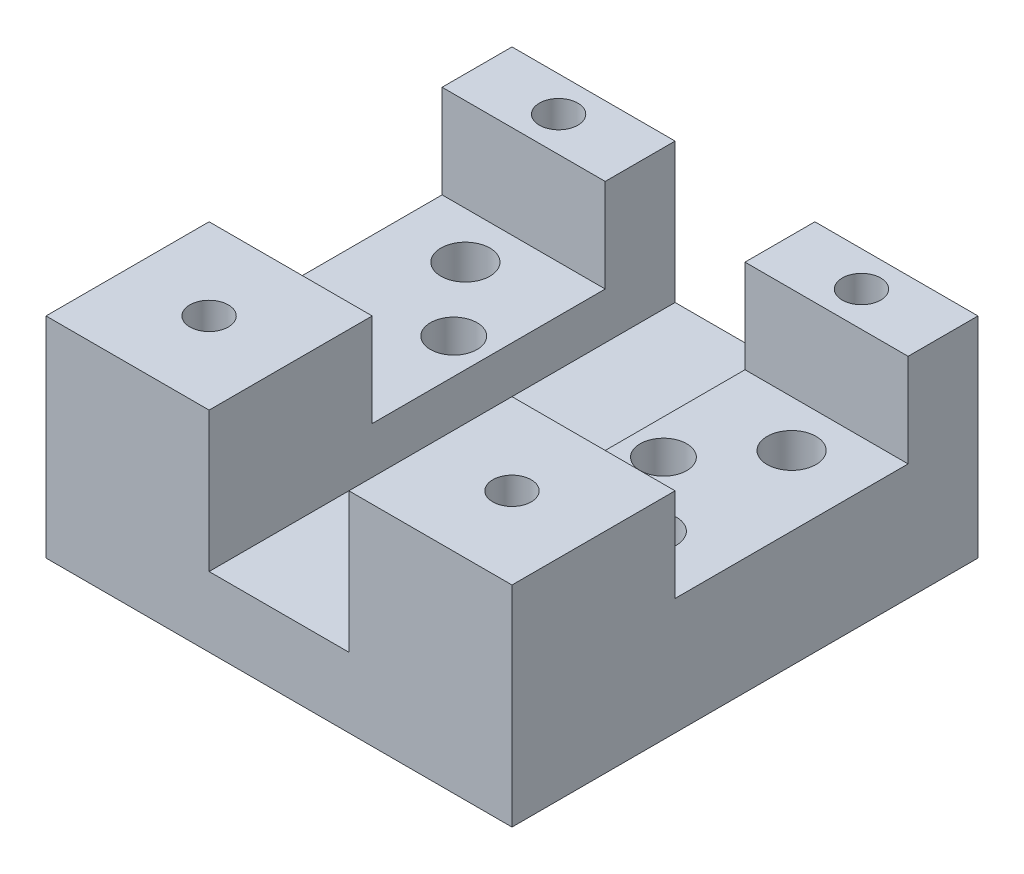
ISO-10303-21;
HEADER;
FILE_DESCRIPTION(('STEP AP214'),'2;1');
FILE_NAME('part.step','',(''),(''),'','','');
FILE_SCHEMA(('AUTOMOTIVE_DESIGN { 1 0 10303 214 1 1 1 1 }'));
ENDSEC;
DATA;
#1=APPLICATION_CONTEXT('core data for automotive mechanical design processes');
#2=APPLICATION_PROTOCOL_DEFINITION('international standard','automotive_design',2000,#1);
#3=PRODUCT_CONTEXT('',#1,'mechanical');
#4=PRODUCT('Part','Part','',(#3));
#5=PRODUCT_RELATED_PRODUCT_CATEGORY('part','',(#4));
#6=PRODUCT_DEFINITION_FORMATION('','',#4);
#7=PRODUCT_DEFINITION_CONTEXT('part definition',#1,'design');
#8=PRODUCT_DEFINITION('design','',#6,#7);
#9=PRODUCT_DEFINITION_SHAPE('','',#8);
#10=(LENGTH_UNIT() NAMED_UNIT(*) SI_UNIT(.MILLI.,.METRE.));
#11=(NAMED_UNIT(*) PLANE_ANGLE_UNIT() SI_UNIT($,.RADIAN.));
#12=(NAMED_UNIT(*) SI_UNIT($,.STERADIAN.) SOLID_ANGLE_UNIT());
#13=UNCERTAINTY_MEASURE_WITH_UNIT(LENGTH_MEASURE(1.E-05),#10,'distance_accuracy_value','');
#14=(GEOMETRIC_REPRESENTATION_CONTEXT(3) GLOBAL_UNCERTAINTY_ASSIGNED_CONTEXT((#13)) GLOBAL_UNIT_ASSIGNED_CONTEXT((#10,
#11,#12)) REPRESENTATION_CONTEXT('',''));
#15=CARTESIAN_POINT('',(0.,0.,0.));
#16=DIRECTION('',(0.,0.,1.));
#17=DIRECTION('',(1.,0.,0.));
#18=AXIS2_PLACEMENT_3D('',#15,#16,#17);
#19=CARTESIAN_POINT('',(0.,18.,0.));
#20=DIRECTION('',(0.,1.,0.));
#21=DIRECTION('',(0.,0.,1.));
#22=AXIS2_PLACEMENT_3D('',#19,#20,#21);
#23=PLANE('',#22);
#24=CARTESIAN_POINT('',(13.,18.,-17.));
#25=DIRECTION('',(0.,1.,0.));
#26=DIRECTION('',(0.,0.,1.));
#27=AXIS2_PLACEMENT_3D('',#24,#25,#26);
#28=CIRCLE('',#27,1.65);
#29=CARTESIAN_POINT('',(13.,18.,-15.35));
#30=VERTEX_POINT('',#29);
#31=EDGE_CURVE('E168',#30,#30,#28,.T.);
#32=ORIENTED_EDGE('',*,*,#31,.F.);
#33=EDGE_LOOP('',(#32));
#34=FACE_BOUND('',#33,.T.);
#35=DIRECTION('',(-1.,0.,0.));
#36=VECTOR('',#35,1.);
#37=CARTESIAN_POINT('',(31.,18.,-14.));
#38=LINE('',#37,#36);
#39=CARTESIAN_POINT('',(20.,18.,-14.));
#40=VERTEX_POINT('',#39);
#41=CARTESIAN_POINT('',(6.,18.,-14.));
#42=VERTEX_POINT('',#41);
#43=EDGE_CURVE('E215',#40,#42,#38,.T.);
#44=ORIENTED_EDGE('',*,*,#43,.F.);
#45=DIRECTION('',(0.,0.,-1.));
#46=VECTOR('',#45,1.);
#47=CARTESIAN_POINT('',(20.,18.,-20.));
#48=LINE('',#47,#46);
#49=CARTESIAN_POINT('',(20.,18.,-20.));
#50=VERTEX_POINT('',#49);
#51=EDGE_CURVE('E267',#40,#50,#48,.T.);
#52=ORIENTED_EDGE('',*,*,#51,.T.);
#53=DIRECTION('',(-1.,0.,0.));
#54=VECTOR('',#53,1.);
#55=CARTESIAN_POINT('',(-20.,18.,-20.));
#56=LINE('',#55,#54);
#57=CARTESIAN_POINT('',(6.,18.,-20.));
#58=VERTEX_POINT('',#57);
#59=EDGE_CURVE('E268',#50,#58,#56,.T.);
#60=ORIENTED_EDGE('',*,*,#59,.T.);
#61=DIRECTION('',(0.,0.,-1.));
#62=VECTOR('',#61,1.);
#63=CARTESIAN_POINT('',(6.,18.,0.));
#64=LINE('',#63,#62);
#65=EDGE_CURVE('E303',#42,#58,#64,.T.);
#66=ORIENTED_EDGE('',*,*,#65,.F.);
#67=EDGE_LOOP('',(#44,#52,#60,#66));
#68=FACE_BOUND('',#67,.T.);
#69=ADVANCED_FACE('F16',(#34,#68),#23,.T.);
#70=CARTESIAN_POINT('',(-13.,18.,-17.));
#71=DIRECTION('',(0.,1.,0.));
#72=DIRECTION('',(0.,0.,1.));
#73=AXIS2_PLACEMENT_3D('',#70,#71,#72);
#74=CIRCLE('',#73,1.65);
#75=CARTESIAN_POINT('',(-13.,18.,-15.35));
#76=VERTEX_POINT('',#75);
#77=EDGE_CURVE('E162',#76,#76,#74,.T.);
#78=ORIENTED_EDGE('',*,*,#77,.F.);
#79=EDGE_LOOP('',(#78));
#80=FACE_BOUND('',#79,.T.);
#81=CARTESIAN_POINT('',(-6.,18.,-14.));
#82=VERTEX_POINT('',#81);
#83=CARTESIAN_POINT('',(-20.,18.,-14.));
#84=VERTEX_POINT('',#83);
#85=EDGE_CURVE('E213',#82,#84,#38,.T.);
#86=ORIENTED_EDGE('',*,*,#85,.F.);
#87=DIRECTION('',(0.,0.,1.));
#88=VECTOR('',#87,1.);
#89=CARTESIAN_POINT('',(-6.,18.,0.));
#90=LINE('',#89,#88);
#91=CARTESIAN_POINT('',(-6.,18.,-20.));
#92=VERTEX_POINT('',#91);
#93=EDGE_CURVE('E300',#92,#82,#90,.T.);
#94=ORIENTED_EDGE('',*,*,#93,.F.);
#95=CARTESIAN_POINT('',(-20.,18.,-20.));
#96=VERTEX_POINT('',#95);
#97=EDGE_CURVE('E266',#92,#96,#56,.T.);
#98=ORIENTED_EDGE('',*,*,#97,.T.);
#99=DIRECTION('',(0.,0.,1.));
#100=VECTOR('',#99,1.);
#101=CARTESIAN_POINT('',(-20.,18.,-20.));
#102=LINE('',#101,#100);
#103=EDGE_CURVE('E272',#96,#84,#102,.T.);
#104=ORIENTED_EDGE('',*,*,#103,.T.);
#105=EDGE_LOOP('',(#86,#94,#98,#104));
#106=FACE_BOUND('',#105,.T.);
#107=ADVANCED_FACE('F336',(#80,#106),#23,.T.);
#108=CARTESIAN_POINT('',(13.,18.,13.));
#109=DIRECTION('',(0.,1.,0.));
#110=DIRECTION('',(0.,0.,1.));
#111=AXIS2_PLACEMENT_3D('',#108,#109,#110);
#112=CIRCLE('',#111,1.65);
#113=CARTESIAN_POINT('',(13.,18.,14.65));
#114=VERTEX_POINT('',#113);
#115=EDGE_CURVE('E151',#114,#114,#112,.T.);
#116=ORIENTED_EDGE('',*,*,#115,.F.);
#117=EDGE_LOOP('',(#116));
#118=FACE_BOUND('',#117,.T.);
#119=DIRECTION('',(-1.,0.,0.));
#120=VECTOR('',#119,1.);
#121=CARTESIAN_POINT('',(31.,18.,6.));
#122=LINE('',#121,#120);
#123=CARTESIAN_POINT('',(20.,18.,6.));
#124=VERTEX_POINT('',#123);
#125=CARTESIAN_POINT('',(6.,18.,6.));
#126=VERTEX_POINT('',#125);
#127=EDGE_CURVE('E216',#124,#126,#122,.T.);
#128=ORIENTED_EDGE('',*,*,#127,.T.);
#129=CARTESIAN_POINT('',(6.,18.,20.));
#130=VERTEX_POINT('',#129);
#131=EDGE_CURVE('E304',#130,#126,#64,.T.);
#132=ORIENTED_EDGE('',*,*,#131,.F.);
#133=DIRECTION('',(1.,0.,0.));
#134=VECTOR('',#133,1.);
#135=CARTESIAN_POINT('',(-20.,18.,20.));
#136=LINE('',#135,#134);
#137=CARTESIAN_POINT('',(20.,18.,20.));
#138=VERTEX_POINT('',#137);
#139=EDGE_CURVE('E275',#130,#138,#136,.T.);
#140=ORIENTED_EDGE('',*,*,#139,.T.);
#141=EDGE_CURVE('E263',#138,#124,#48,.T.);
#142=ORIENTED_EDGE('',*,*,#141,.T.);
#143=EDGE_LOOP('',(#128,#132,#140,#142));
#144=FACE_BOUND('',#143,.T.);
#145=ADVANCED_FACE('F344',(#118,#144),#23,.T.);
#146=CARTESIAN_POINT('',(20.,18.,-20.));
#147=DIRECTION('',(-1.,0.,0.));
#148=DIRECTION('',(0.,0.,1.));
#149=AXIS2_PLACEMENT_3D('',#146,#147,#148);
#150=PLANE('',#149);
#151=ORIENTED_EDGE('',*,*,#51,.F.);
#152=DIRECTION('',(0.,-1.,0.));
#153=VECTOR('',#152,1.);
#154=CARTESIAN_POINT('',(20.,18.,-14.));
#155=LINE('',#154,#153);
#156=CARTESIAN_POINT('',(20.,10.,-14.));
#157=VERTEX_POINT('',#156);
#158=EDGE_CURVE('E238',#40,#157,#155,.T.);
#159=ORIENTED_EDGE('',*,*,#158,.T.);
#160=DIRECTION('',(0.,0.,1.));
#161=VECTOR('',#160,1.);
#162=CARTESIAN_POINT('',(20.,10.,-20.));
#163=LINE('',#162,#161);
#164=CARTESIAN_POINT('',(20.,10.,6.));
#165=VERTEX_POINT('',#164);
#166=EDGE_CURVE('E226',#157,#165,#163,.T.);
#167=ORIENTED_EDGE('',*,*,#166,.T.);
#168=DIRECTION('',(0.,1.,0.));
#169=VECTOR('',#168,1.);
#170=CARTESIAN_POINT('',(20.,18.,6.));
#171=LINE('',#170,#169);
#172=EDGE_CURVE('E232',#165,#124,#171,.T.);
#173=ORIENTED_EDGE('',*,*,#172,.T.);
#174=ORIENTED_EDGE('',*,*,#141,.F.);
#175=DIRECTION('',(0.,-1.,0.));
#176=VECTOR('',#175,1.);
#177=CARTESIAN_POINT('',(20.,18.,20.));
#178=LINE('',#177,#176);
#179=CARTESIAN_POINT('',(20.,0.,20.));
#180=VERTEX_POINT('',#179);
#181=EDGE_CURVE('E279',#138,#180,#178,.T.);
#182=ORIENTED_EDGE('',*,*,#181,.T.);
#183=DIRECTION('',(0.,0.,-1.));
#184=VECTOR('',#183,1.);
#185=CARTESIAN_POINT('',(20.,0.,-20.));
#186=LINE('',#185,#184);
#187=CARTESIAN_POINT('',(20.,0.,-20.));
#188=VERTEX_POINT('',#187);
#189=EDGE_CURVE('E262',#180,#188,#186,.T.);
#190=ORIENTED_EDGE('',*,*,#189,.T.);
#191=DIRECTION('',(0.,-1.,0.));
#192=VECTOR('',#191,1.);
#193=CARTESIAN_POINT('',(20.,18.,-20.));
#194=LINE('',#193,#192);
#195=EDGE_CURVE('E296',#50,#188,#194,.T.);
#196=ORIENTED_EDGE('',*,*,#195,.F.);
#197=EDGE_LOOP('',(#151,#159,#167,#173,#174,#182,#190,#196));
#198=FACE_BOUND('',#197,.T.);
#199=ADVANCED_FACE('F18',(#198),#150,.F.);
#200=CARTESIAN_POINT('',(-20.,18.,-20.));
#201=DIRECTION('',(0.,0.,1.));
#202=DIRECTION('',(1.,0.,0.));
#203=AXIS2_PLACEMENT_3D('',#200,#201,#202);
#204=PLANE('',#203);
#205=DIRECTION('',(1.,0.,0.));
#206=VECTOR('',#205,1.);
#207=CARTESIAN_POINT('',(-20.,6.,-20.));
#208=LINE('',#207,#206);
#209=CARTESIAN_POINT('',(-6.,6.,-20.));
#210=VERTEX_POINT('',#209);
#211=CARTESIAN_POINT('',(6.,6.,-20.));
#212=VERTEX_POINT('',#211);
#213=EDGE_CURVE('E259',#210,#212,#208,.T.);
#214=ORIENTED_EDGE('',*,*,#213,.T.);
#215=DIRECTION('',(0.,1.,0.));
#216=VECTOR('',#215,1.);
#217=CARTESIAN_POINT('',(6.,18.,-20.));
#218=LINE('',#217,#216);
#219=EDGE_CURVE('E256',#212,#58,#218,.T.);
#220=ORIENTED_EDGE('',*,*,#219,.T.);
#221=ORIENTED_EDGE('',*,*,#59,.F.);
#222=ORIENTED_EDGE('',*,*,#195,.T.);
#223=DIRECTION('',(-1.,0.,0.));
#224=VECTOR('',#223,1.);
#225=CARTESIAN_POINT('',(-20.,0.,-20.));
#226=LINE('',#225,#224);
#227=CARTESIAN_POINT('',(-20.,0.,-20.));
#228=VERTEX_POINT('',#227);
#229=EDGE_CURVE('E282',#188,#228,#226,.T.);
#230=ORIENTED_EDGE('',*,*,#229,.T.);
#231=DIRECTION('',(0.,-1.,0.));
#232=VECTOR('',#231,1.);
#233=CARTESIAN_POINT('',(-20.,18.,-20.));
#234=LINE('',#233,#232);
#235=EDGE_CURVE('E293',#96,#228,#234,.T.);
#236=ORIENTED_EDGE('',*,*,#235,.F.);
#237=ORIENTED_EDGE('',*,*,#97,.F.);
#238=DIRECTION('',(0.,-1.,0.));
#239=VECTOR('',#238,1.);
#240=CARTESIAN_POINT('',(-6.,18.,-20.));
#241=LINE('',#240,#239);
#242=EDGE_CURVE('E252',#92,#210,#241,.T.);
#243=ORIENTED_EDGE('',*,*,#242,.T.);
#244=EDGE_LOOP('',(#214,#220,#221,#222,#230,#236,#237,#243));
#245=FACE_BOUND('',#244,.T.);
#246=ADVANCED_FACE('F372',(#245),#204,.F.);
#247=CARTESIAN_POINT('',(-20.,18.,-20.));
#248=DIRECTION('',(1.,0.,0.));
#249=DIRECTION('',(0.,0.,-1.));
#250=AXIS2_PLACEMENT_3D('',#247,#248,#249);
#251=PLANE('',#250);
#252=DIRECTION('',(0.,0.,1.));
#253=VECTOR('',#252,1.);
#254=CARTESIAN_POINT('',(-20.,10.,-14.));
#255=LINE('',#254,#253);
#256=CARTESIAN_POINT('',(-20.,10.,-14.));
#257=VERTEX_POINT('',#256);
#258=CARTESIAN_POINT('',(-20.,10.,6.));
#259=VERTEX_POINT('',#258);
#260=EDGE_CURVE('E208',#257,#259,#255,.T.);
#261=ORIENTED_EDGE('',*,*,#260,.F.);
#262=DIRECTION('',(0.,-1.,0.));
#263=VECTOR('',#262,1.);
#264=CARTESIAN_POINT('',(-20.,18.,-14.));
#265=LINE('',#264,#263);
#266=EDGE_CURVE('E205',#84,#257,#265,.T.);
#267=ORIENTED_EDGE('',*,*,#266,.F.);
#268=ORIENTED_EDGE('',*,*,#103,.F.);
#269=ORIENTED_EDGE('',*,*,#235,.T.);
#270=DIRECTION('',(0.,0.,1.));
#271=VECTOR('',#270,1.);
#272=CARTESIAN_POINT('',(-20.,0.,-20.));
#273=LINE('',#272,#271);
#274=CARTESIAN_POINT('',(-20.,0.,20.));
#275=VERTEX_POINT('',#274);
#276=EDGE_CURVE('E284',#228,#275,#273,.T.);
#277=ORIENTED_EDGE('',*,*,#276,.T.);
#278=DIRECTION('',(0.,-1.,0.));
#279=VECTOR('',#278,1.);
#280=CARTESIAN_POINT('',(-20.,18.,20.));
#281=LINE('',#280,#279);
#282=CARTESIAN_POINT('',(-20.,18.,20.));
#283=VERTEX_POINT('',#282);
#284=EDGE_CURVE('E290',#283,#275,#281,.T.);
#285=ORIENTED_EDGE('',*,*,#284,.F.);
#286=CARTESIAN_POINT('',(-20.,18.,6.));
#287=VERTEX_POINT('',#286);
#288=EDGE_CURVE('E271',#287,#283,#102,.T.);
#289=ORIENTED_EDGE('',*,*,#288,.F.);
#290=DIRECTION('',(0.,1.,0.));
#291=VECTOR('',#290,1.);
#292=CARTESIAN_POINT('',(-20.,18.,6.));
#293=LINE('',#292,#291);
#294=EDGE_CURVE('E210',#259,#287,#293,.T.);
#295=ORIENTED_EDGE('',*,*,#294,.F.);
#296=EDGE_LOOP('',(#261,#267,#268,#269,#277,#285,#289,#295));
#297=FACE_BOUND('',#296,.T.);
#298=ADVANCED_FACE('F361',(#297),#251,.F.);
#299=CARTESIAN_POINT('',(-20.,18.,20.));
#300=DIRECTION('',(0.,0.,-1.));
#301=DIRECTION('',(-1.,0.,0.));
#302=AXIS2_PLACEMENT_3D('',#299,#300,#301);
#303=PLANE('',#302);
#304=ORIENTED_EDGE('',*,*,#139,.F.);
#305=DIRECTION('',(0.,1.,0.));
#306=VECTOR('',#305,1.);
#307=CARTESIAN_POINT('',(6.,30.,20.));
#308=LINE('',#307,#306);
#309=CARTESIAN_POINT('',(6.,6.,20.));
#310=VERTEX_POINT('',#309);
#311=EDGE_CURVE('E241',#310,#130,#308,.T.);
#312=ORIENTED_EDGE('',*,*,#311,.F.);
#313=DIRECTION('',(1.,0.,0.));
#314=VECTOR('',#313,1.);
#315=CARTESIAN_POINT('',(-6.,6.,20.));
#316=LINE('',#315,#314);
#317=CARTESIAN_POINT('',(-6.,6.,20.));
#318=VERTEX_POINT('',#317);
#319=EDGE_CURVE('E246',#318,#310,#316,.T.);
#320=ORIENTED_EDGE('',*,*,#319,.F.);
#321=DIRECTION('',(0.,-1.,0.));
#322=VECTOR('',#321,1.);
#323=CARTESIAN_POINT('',(-6.,30.,20.));
#324=LINE('',#323,#322);
#325=CARTESIAN_POINT('',(-6.,18.,20.));
#326=VERTEX_POINT('',#325);
#327=EDGE_CURVE('E243',#326,#318,#324,.T.);
#328=ORIENTED_EDGE('',*,*,#327,.F.);
#329=EDGE_CURVE('E276',#283,#326,#136,.T.);
#330=ORIENTED_EDGE('',*,*,#329,.F.);
#331=ORIENTED_EDGE('',*,*,#284,.T.);
#332=DIRECTION('',(1.,0.,0.));
#333=VECTOR('',#332,1.);
#334=CARTESIAN_POINT('',(-20.,0.,20.));
#335=LINE('',#334,#333);
#336=EDGE_CURVE('E286',#275,#180,#335,.T.);
#337=ORIENTED_EDGE('',*,*,#336,.T.);
#338=ORIENTED_EDGE('',*,*,#181,.F.);
#339=EDGE_LOOP('',(#304,#312,#320,#328,#330,#331,#337,#338));
#340=FACE_BOUND('',#339,.T.);
#341=ADVANCED_FACE('F352',(#340),#303,.F.);
#342=CARTESIAN_POINT('',(-13.,18.,13.));
#343=DIRECTION('',(0.,1.,0.));
#344=DIRECTION('',(0.,0.,1.));
#345=AXIS2_PLACEMENT_3D('',#342,#343,#344);
#346=CIRCLE('',#345,1.65);
#347=CARTESIAN_POINT('',(-13.,18.,14.65));
#348=VERTEX_POINT('',#347);
#349=EDGE_CURVE('E152',#348,#348,#346,.T.);
#350=ORIENTED_EDGE('',*,*,#349,.F.);
#351=EDGE_LOOP('',(#350));
#352=FACE_BOUND('',#351,.T.);
#353=CARTESIAN_POINT('',(-6.,18.,6.));
#354=VERTEX_POINT('',#353);
#355=EDGE_CURVE('E217',#354,#287,#122,.T.);
#356=ORIENTED_EDGE('',*,*,#355,.T.);
#357=ORIENTED_EDGE('',*,*,#288,.T.);
#358=ORIENTED_EDGE('',*,*,#329,.T.);
#359=EDGE_CURVE('E299',#354,#326,#90,.T.);
#360=ORIENTED_EDGE('',*,*,#359,.F.);
#361=EDGE_LOOP('',(#356,#357,#358,#360));
#362=FACE_BOUND('',#361,.T.);
#363=ADVANCED_FACE('F339',(#352,#362),#23,.T.);
#364=CARTESIAN_POINT('',(0.,0.,0.));
#365=DIRECTION('',(0.,1.,0.));
#366=DIRECTION('',(0.,0.,1.));
#367=AXIS2_PLACEMENT_3D('',#364,#365,#366);
#368=PLANE('',#367);
#369=CARTESIAN_POINT('',(9.,0.,-4.));
#370=DIRECTION('',(0.,1.,0.));
#371=DIRECTION('',(0.,0.,1.));
#372=AXIS2_PLACEMENT_3D('',#369,#370,#371);
#373=CIRCLE('',#372,2.);
#374=CARTESIAN_POINT('',(9.,0.,-2.));
#375=VERTEX_POINT('',#374);
#376=EDGE_CURVE('E177',#375,#375,#373,.T.);
#377=ORIENTED_EDGE('',*,*,#376,.T.);
#378=EDGE_LOOP('',(#377));
#379=FACE_BOUND('',#378,.T.);
#380=CARTESIAN_POINT('',(-9.,0.,-4.));
#381=DIRECTION('',(0.,1.,0.));
#382=DIRECTION('',(0.,0.,1.));
#383=AXIS2_PLACEMENT_3D('',#380,#381,#382);
#384=CIRCLE('',#383,2.);
#385=CARTESIAN_POINT('',(-9.,0.,-2.));
#386=VERTEX_POINT('',#385);
#387=EDGE_CURVE('E183',#386,#386,#384,.T.);
#388=ORIENTED_EDGE('',*,*,#387,.T.);
#389=EDGE_LOOP('',(#388));
#390=FACE_BOUND('',#389,.T.);
#391=CARTESIAN_POINT('',(14.,0.,-10.));
#392=DIRECTION('',(0.,-1.,0.));
#393=DIRECTION('',(0.,0.,-1.));
#394=AXIS2_PLACEMENT_3D('',#391,#392,#393);
#395=CIRCLE('',#394,2.1);
#396=CARTESIAN_POINT('',(14.,0.,-12.1));
#397=VERTEX_POINT('',#396);
#398=EDGE_CURVE('E186',#397,#397,#395,.T.);
#399=ORIENTED_EDGE('',*,*,#398,.F.);
#400=EDGE_LOOP('',(#399));
#401=FACE_BOUND('',#400,.T.);
#402=CARTESIAN_POINT('',(-14.,0.,-10.));
#403=DIRECTION('',(0.,-1.,0.));
#404=DIRECTION('',(0.,0.,-1.));
#405=AXIS2_PLACEMENT_3D('',#402,#403,#404);
#406=CIRCLE('',#405,2.1);
#407=CARTESIAN_POINT('',(-14.,0.,-12.1));
#408=VERTEX_POINT('',#407);
#409=EDGE_CURVE('E192',#408,#408,#406,.T.);
#410=ORIENTED_EDGE('',*,*,#409,.F.);
#411=EDGE_LOOP('',(#410));
#412=FACE_BOUND('',#411,.T.);
#413=CARTESIAN_POINT('',(14.,0.,2.));
#414=DIRECTION('',(0.,-1.,0.));
#415=DIRECTION('',(0.,0.,-1.));
#416=AXIS2_PLACEMENT_3D('',#413,#414,#415);
#417=CIRCLE('',#416,2.1);
#418=CARTESIAN_POINT('',(14.,0.,-0.0999999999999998));
#419=VERTEX_POINT('',#418);
#420=EDGE_CURVE('E195',#419,#419,#417,.T.);
#421=ORIENTED_EDGE('',*,*,#420,.F.);
#422=EDGE_LOOP('',(#421));
#423=FACE_BOUND('',#422,.T.);
#424=CARTESIAN_POINT('',(-14.,0.,2.));
#425=DIRECTION('',(0.,-1.,0.));
#426=DIRECTION('',(0.,0.,-1.));
#427=AXIS2_PLACEMENT_3D('',#424,#425,#426);
#428=CIRCLE('',#427,2.1);
#429=CARTESIAN_POINT('',(-14.,0.,-0.0999999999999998));
#430=VERTEX_POINT('',#429);
#431=EDGE_CURVE('E201',#430,#430,#428,.T.);
#432=ORIENTED_EDGE('',*,*,#431,.F.);
#433=EDGE_LOOP('',(#432));
#434=FACE_BOUND('',#433,.T.);
#435=ORIENTED_EDGE('',*,*,#189,.F.);
#436=ORIENTED_EDGE('',*,*,#336,.F.);
#437=ORIENTED_EDGE('',*,*,#276,.F.);
#438=ORIENTED_EDGE('',*,*,#229,.F.);
#439=EDGE_LOOP('',(#435,#436,#437,#438));
#440=FACE_BOUND('',#439,.T.);
#441=ADVANCED_FACE('F351',(#379,#390,#401,#412,#423,#434,#440),#368,.F.);
#442=CARTESIAN_POINT('',(-6.,6.,-31.));
#443=DIRECTION('',(0.,-1.,0.));
#444=DIRECTION('',(0.,0.,-1.));
#445=AXIS2_PLACEMENT_3D('',#442,#443,#444);
#446=PLANE('',#445);
#447=DIRECTION('',(0.,0.,1.));
#448=VECTOR('',#447,1.);
#449=CARTESIAN_POINT('',(-6.,6.,-31.));
#450=LINE('',#449,#448);
#451=EDGE_CURVE('E249',#210,#318,#450,.T.);
#452=ORIENTED_EDGE('',*,*,#451,.T.);
#453=ORIENTED_EDGE('',*,*,#319,.T.);
#454=DIRECTION('',(0.,0.,1.));
#455=VECTOR('',#454,1.);
#456=CARTESIAN_POINT('',(6.,6.,-31.));
#457=LINE('',#456,#455);
#458=EDGE_CURVE('E250',#212,#310,#457,.T.);
#459=ORIENTED_EDGE('',*,*,#458,.F.);
#460=ORIENTED_EDGE('',*,*,#213,.F.);
#461=EDGE_LOOP('',(#452,#453,#459,#460));
#462=FACE_BOUND('',#461,.T.);
#463=ADVANCED_FACE('F359',(#462),#446,.F.);
#464=CARTESIAN_POINT('',(6.,30.,-31.));
#465=DIRECTION('',(1.,0.,0.));
#466=DIRECTION('',(0.,0.,-1.));
#467=AXIS2_PLACEMENT_3D('',#464,#465,#466);
#468=PLANE('',#467);
#469=DIRECTION('',(0.,0.,-1.));
#470=VECTOR('',#469,1.);
#471=CARTESIAN_POINT('',(6.,10.,-31.));
#472=LINE('',#471,#470);
#473=CARTESIAN_POINT('',(6.,10.,6.));
#474=VERTEX_POINT('',#473);
#475=CARTESIAN_POINT('',(6.,10.,-14.));
#476=VERTEX_POINT('',#475);
#477=EDGE_CURVE('E223',#474,#476,#472,.T.);
#478=ORIENTED_EDGE('',*,*,#477,.T.);
#479=DIRECTION('',(0.,1.,0.));
#480=VECTOR('',#479,1.);
#481=CARTESIAN_POINT('',(6.,30.,-14.));
#482=LINE('',#481,#480);
#483=EDGE_CURVE('E235',#476,#42,#482,.T.);
#484=ORIENTED_EDGE('',*,*,#483,.T.);
#485=ORIENTED_EDGE('',*,*,#65,.T.);
#486=ORIENTED_EDGE('',*,*,#219,.F.);
#487=ORIENTED_EDGE('',*,*,#458,.T.);
#488=ORIENTED_EDGE('',*,*,#311,.T.);
#489=ORIENTED_EDGE('',*,*,#131,.T.);
#490=DIRECTION('',(0.,-1.,0.));
#491=VECTOR('',#490,1.);
#492=CARTESIAN_POINT('',(6.,30.,6.));
#493=LINE('',#492,#491);
#494=EDGE_CURVE('E229',#126,#474,#493,.T.);
#495=ORIENTED_EDGE('',*,*,#494,.T.);
#496=EDGE_LOOP('',(#478,#484,#485,#486,#487,#488,#489,#495));
#497=FACE_BOUND('',#496,.T.);
#498=ADVANCED_FACE('F382',(#497),#468,.F.);
#499=CARTESIAN_POINT('',(-6.,30.,-31.));
#500=DIRECTION('',(-1.,0.,0.));
#501=DIRECTION('',(0.,0.,1.));
#502=AXIS2_PLACEMENT_3D('',#499,#500,#501);
#503=PLANE('',#502);
#504=ORIENTED_EDGE('',*,*,#93,.T.);
#505=DIRECTION('',(0.,-1.,0.));
#506=VECTOR('',#505,1.);
#507=CARTESIAN_POINT('',(-6.,30.,-14.));
#508=LINE('',#507,#506);
#509=CARTESIAN_POINT('',(-6.,10.,-14.));
#510=VERTEX_POINT('',#509);
#511=EDGE_CURVE('E11',#82,#510,#508,.T.);
#512=ORIENTED_EDGE('',*,*,#511,.T.);
#513=DIRECTION('',(0.,0.,1.));
#514=VECTOR('',#513,1.);
#515=CARTESIAN_POINT('',(-6.,10.,-31.));
#516=LINE('',#515,#514);
#517=CARTESIAN_POINT('',(-6.,10.,6.));
#518=VERTEX_POINT('',#517);
#519=EDGE_CURVE('E307',#510,#518,#516,.T.);
#520=ORIENTED_EDGE('',*,*,#519,.T.);
#521=DIRECTION('',(0.,1.,0.));
#522=VECTOR('',#521,1.);
#523=CARTESIAN_POINT('',(-6.,30.,6.));
#524=LINE('',#523,#522);
#525=EDGE_CURVE('E25',#518,#354,#524,.T.);
#526=ORIENTED_EDGE('',*,*,#525,.T.);
#527=ORIENTED_EDGE('',*,*,#359,.T.);
#528=ORIENTED_EDGE('',*,*,#327,.T.);
#529=ORIENTED_EDGE('',*,*,#451,.F.);
#530=ORIENTED_EDGE('',*,*,#242,.F.);
#531=EDGE_LOOP('',(#504,#512,#520,#526,#527,#528,#529,#530));
#532=FACE_BOUND('',#531,.T.);
#533=ADVANCED_FACE('F413',(#532),#503,.F.);
#534=CARTESIAN_POINT('',(31.,10.,-14.));
#535=DIRECTION('',(0.,-1.,0.));
#536=DIRECTION('',(0.,0.,-1.));
#537=AXIS2_PLACEMENT_3D('',#534,#535,#536);
#538=PLANE('',#537);
#539=CARTESIAN_POINT('',(-9.,10.,-4.));
#540=DIRECTION('',(0.,1.,0.));
#541=DIRECTION('',(0.,0.,1.));
#542=AXIS2_PLACEMENT_3D('',#539,#540,#541);
#543=CIRCLE('',#542,2.);
#544=CARTESIAN_POINT('',(-9.,10.,-2.));
#545=VERTEX_POINT('',#544);
#546=EDGE_CURVE('E180',#545,#545,#543,.T.);
#547=ORIENTED_EDGE('',*,*,#546,.F.);
#548=EDGE_LOOP('',(#547));
#549=FACE_BOUND('',#548,.T.);
#550=CARTESIAN_POINT('',(-14.,10.,-10.));
#551=DIRECTION('',(0.,-1.,0.));
#552=DIRECTION('',(0.,0.,-1.));
#553=AXIS2_PLACEMENT_3D('',#550,#551,#552);
#554=CIRCLE('',#553,2.1);
#555=CARTESIAN_POINT('',(-14.,10.,-12.1));
#556=VERTEX_POINT('',#555);
#557=EDGE_CURVE('E20',#556,#556,#554,.T.);
#558=ORIENTED_EDGE('',*,*,#557,.T.);
#559=EDGE_LOOP('',(#558));
#560=FACE_BOUND('',#559,.T.);
#561=CARTESIAN_POINT('',(-14.,10.,2.));
#562=DIRECTION('',(0.,-1.,0.));
#563=DIRECTION('',(0.,0.,-1.));
#564=AXIS2_PLACEMENT_3D('',#561,#562,#563);
#565=CIRCLE('',#564,2.1);
#566=CARTESIAN_POINT('',(-14.,10.,-0.0999999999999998));
#567=VERTEX_POINT('',#566);
#568=EDGE_CURVE('E204',#567,#567,#565,.T.);
#569=ORIENTED_EDGE('',*,*,#568,.T.);
#570=EDGE_LOOP('',(#569));
#571=FACE_BOUND('',#570,.T.);
#572=DIRECTION('',(-1.,0.,0.));
#573=VECTOR('',#572,1.);
#574=CARTESIAN_POINT('',(31.,10.,-14.));
#575=LINE('',#574,#573);
#576=EDGE_CURVE('E212',#510,#257,#575,.T.);
#577=ORIENTED_EDGE('',*,*,#576,.T.);
#578=ORIENTED_EDGE('',*,*,#260,.T.);
#579=DIRECTION('',(-1.,0.,0.));
#580=VECTOR('',#579,1.);
#581=CARTESIAN_POINT('',(31.,10.,6.));
#582=LINE('',#581,#580);
#583=EDGE_CURVE('E41',#518,#259,#582,.T.);
#584=ORIENTED_EDGE('',*,*,#583,.F.);
#585=ORIENTED_EDGE('',*,*,#519,.F.);
#586=EDGE_LOOP('',(#577,#578,#584,#585));
#587=FACE_BOUND('',#586,.T.);
#588=ADVANCED_FACE('F314',(#549,#560,#571,#587),#538,.F.);
#589=CARTESIAN_POINT('',(31.,18.,6.));
#590=DIRECTION('',(0.,0.,1.));
#591=DIRECTION('',(0.,-1.,0.));
#592=AXIS2_PLACEMENT_3D('',#589,#590,#591);
#593=PLANE('',#592);
#594=ORIENTED_EDGE('',*,*,#583,.T.);
#595=ORIENTED_EDGE('',*,*,#294,.T.);
#596=ORIENTED_EDGE('',*,*,#355,.F.);
#597=ORIENTED_EDGE('',*,*,#525,.F.);
#598=EDGE_LOOP('',(#594,#595,#596,#597));
#599=FACE_BOUND('',#598,.T.);
#600=ADVANCED_FACE('F429',(#599),#593,.F.);
#601=CARTESIAN_POINT('',(31.,18.,-14.));
#602=DIRECTION('',(0.,0.,-1.));
#603=DIRECTION('',(0.,1.,0.));
#604=AXIS2_PLACEMENT_3D('',#601,#602,#603);
#605=PLANE('',#604);
#606=ORIENTED_EDGE('',*,*,#85,.T.);
#607=ORIENTED_EDGE('',*,*,#266,.T.);
#608=ORIENTED_EDGE('',*,*,#576,.F.);
#609=ORIENTED_EDGE('',*,*,#511,.F.);
#610=EDGE_LOOP('',(#606,#607,#608,#609));
#611=FACE_BOUND('',#610,.T.);
#612=ADVANCED_FACE('F435',(#611),#605,.F.);
#613=ORIENTED_EDGE('',*,*,#43,.T.);
#614=ORIENTED_EDGE('',*,*,#483,.F.);
#615=EDGE_CURVE('E33',#157,#476,#575,.T.);
#616=ORIENTED_EDGE('',*,*,#615,.F.);
#617=ORIENTED_EDGE('',*,*,#158,.F.);
#618=EDGE_LOOP('',(#613,#614,#616,#617));
#619=FACE_BOUND('',#618,.T.);
#620=ADVANCED_FACE('F423',(#619),#605,.F.);
#621=EDGE_CURVE('E220',#165,#474,#582,.T.);
#622=ORIENTED_EDGE('',*,*,#621,.T.);
#623=ORIENTED_EDGE('',*,*,#494,.F.);
#624=ORIENTED_EDGE('',*,*,#127,.F.);
#625=ORIENTED_EDGE('',*,*,#172,.F.);
#626=EDGE_LOOP('',(#622,#623,#624,#625));
#627=FACE_BOUND('',#626,.T.);
#628=ADVANCED_FACE('F331',(#627),#593,.F.);
#629=CARTESIAN_POINT('',(9.,10.,-4.));
#630=DIRECTION('',(0.,1.,0.));
#631=DIRECTION('',(0.,0.,1.));
#632=AXIS2_PLACEMENT_3D('',#629,#630,#631);
#633=CIRCLE('',#632,2.);
#634=CARTESIAN_POINT('',(9.,10.,-2.));
#635=VERTEX_POINT('',#634);
#636=EDGE_CURVE('E174',#635,#635,#633,.T.);
#637=ORIENTED_EDGE('',*,*,#636,.F.);
#638=EDGE_LOOP('',(#637));
#639=FACE_BOUND('',#638,.T.);
#640=CARTESIAN_POINT('',(14.,10.,-10.));
#641=DIRECTION('',(0.,-1.,0.));
#642=DIRECTION('',(0.,0.,-1.));
#643=AXIS2_PLACEMENT_3D('',#640,#641,#642);
#644=CIRCLE('',#643,2.1);
#645=CARTESIAN_POINT('',(14.,10.,-12.1));
#646=VERTEX_POINT('',#645);
#647=EDGE_CURVE('E189',#646,#646,#644,.T.);
#648=ORIENTED_EDGE('',*,*,#647,.T.);
#649=EDGE_LOOP('',(#648));
#650=FACE_BOUND('',#649,.T.);
#651=CARTESIAN_POINT('',(14.,10.,2.));
#652=DIRECTION('',(0.,-1.,0.));
#653=DIRECTION('',(0.,0.,-1.));
#654=AXIS2_PLACEMENT_3D('',#651,#652,#653);
#655=CIRCLE('',#654,2.1);
#656=CARTESIAN_POINT('',(14.,10.,-0.0999999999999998));
#657=VERTEX_POINT('',#656);
#658=EDGE_CURVE('E198',#657,#657,#655,.T.);
#659=ORIENTED_EDGE('',*,*,#658,.T.);
#660=EDGE_LOOP('',(#659));
#661=FACE_BOUND('',#660,.T.);
#662=ORIENTED_EDGE('',*,*,#615,.T.);
#663=ORIENTED_EDGE('',*,*,#477,.F.);
#664=ORIENTED_EDGE('',*,*,#621,.F.);
#665=ORIENTED_EDGE('',*,*,#166,.F.);
#666=EDGE_LOOP('',(#662,#663,#664,#665));
#667=FACE_BOUND('',#666,.T.);
#668=ADVANCED_FACE('F319',(#639,#650,#661,#667),#538,.F.);
#669=CARTESIAN_POINT('',(-14.,0.,2.));
#670=DIRECTION('',(0.,-1.,0.));
#671=DIRECTION('',(0.,0.,-1.));
#672=AXIS2_PLACEMENT_3D('',#669,#670,#671);
#673=CYLINDRICAL_SURFACE('',#672,2.1);
#674=ORIENTED_EDGE('',*,*,#431,.T.);
#675=EDGE_LOOP('',(#674));
#676=FACE_BOUND('',#675,.T.);
#677=ORIENTED_EDGE('',*,*,#568,.F.);
#678=EDGE_LOOP('',(#677));
#679=FACE_BOUND('',#678,.T.);
#680=ADVANCED_FACE('F316',(#676,#679),#673,.F.);
#681=CARTESIAN_POINT('',(14.,0.,2.));
#682=DIRECTION('',(0.,-1.,0.));
#683=DIRECTION('',(0.,0.,-1.));
#684=AXIS2_PLACEMENT_3D('',#681,#682,#683);
#685=CYLINDRICAL_SURFACE('',#684,2.1);
#686=ORIENTED_EDGE('',*,*,#420,.T.);
#687=EDGE_LOOP('',(#686));
#688=FACE_BOUND('',#687,.T.);
#689=ORIENTED_EDGE('',*,*,#658,.F.);
#690=EDGE_LOOP('',(#689));
#691=FACE_BOUND('',#690,.T.);
#692=ADVANCED_FACE('F318',(#688,#691),#685,.F.);
#693=CARTESIAN_POINT('',(-14.,0.,-10.));
#694=DIRECTION('',(0.,-1.,0.));
#695=DIRECTION('',(0.,0.,-1.));
#696=AXIS2_PLACEMENT_3D('',#693,#694,#695);
#697=CYLINDRICAL_SURFACE('',#696,2.1);
#698=ORIENTED_EDGE('',*,*,#409,.T.);
#699=EDGE_LOOP('',(#698));
#700=FACE_BOUND('',#699,.T.);
#701=ORIENTED_EDGE('',*,*,#557,.F.);
#702=EDGE_LOOP('',(#701));
#703=FACE_BOUND('',#702,.T.);
#704=ADVANCED_FACE('F328',(#700,#703),#697,.F.);
#705=CARTESIAN_POINT('',(14.,0.,-10.));
#706=DIRECTION('',(0.,-1.,0.));
#707=DIRECTION('',(0.,0.,-1.));
#708=AXIS2_PLACEMENT_3D('',#705,#706,#707);
#709=CYLINDRICAL_SURFACE('',#708,2.1);
#710=ORIENTED_EDGE('',*,*,#398,.T.);
#711=EDGE_LOOP('',(#710));
#712=FACE_BOUND('',#711,.T.);
#713=ORIENTED_EDGE('',*,*,#647,.F.);
#714=EDGE_LOOP('',(#713));
#715=FACE_BOUND('',#714,.T.);
#716=ADVANCED_FACE('F623',(#712,#715),#709,.F.);
#717=CARTESIAN_POINT('',(-9.,-14.,-4.));
#718=DIRECTION('',(0.,1.,0.));
#719=DIRECTION('',(0.,0.,1.));
#720=AXIS2_PLACEMENT_3D('',#717,#718,#719);
#721=CYLINDRICAL_SURFACE('',#720,2.);
#722=ORIENTED_EDGE('',*,*,#546,.T.);
#723=EDGE_LOOP('',(#722));
#724=FACE_BOUND('',#723,.T.);
#725=ORIENTED_EDGE('',*,*,#387,.F.);
#726=EDGE_LOOP('',(#725));
#727=FACE_BOUND('',#726,.T.);
#728=ADVANCED_FACE('F615',(#724,#727),#721,.F.);
#729=CARTESIAN_POINT('',(9.,-14.,-4.));
#730=DIRECTION('',(0.,1.,0.));
#731=DIRECTION('',(0.,0.,1.));
#732=AXIS2_PLACEMENT_3D('',#729,#730,#731);
#733=CYLINDRICAL_SURFACE('',#732,2.);
#734=ORIENTED_EDGE('',*,*,#636,.T.);
#735=EDGE_LOOP('',(#734));
#736=FACE_BOUND('',#735,.T.);
#737=ORIENTED_EDGE('',*,*,#376,.F.);
#738=EDGE_LOOP('',(#737));
#739=FACE_BOUND('',#738,.T.);
#740=ADVANCED_FACE('F607',(#736,#739),#733,.F.);
#741=CARTESIAN_POINT('',(13.,7.9,-17.));
#742=DIRECTION('',(0.,1.,0.));
#743=DIRECTION('',(0.,0.,1.));
#744=AXIS2_PLACEMENT_3D('',#741,#742,#743);
#745=CONICAL_SURFACE('',#744,1.65,1.02974425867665);
#746=CARTESIAN_POINT('',(13.,6.90857997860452,-17.));
#747=VERTEX_POINT('',#746);
#748=VERTEX_LOOP('',#747);
#749=FACE_BOUND('',#748,.T.);
#750=CARTESIAN_POINT('',(13.,7.9,-17.));
#751=DIRECTION('',(0.,1.,0.));
#752=DIRECTION('',(0.,0.,1.));
#753=AXIS2_PLACEMENT_3D('',#750,#751,#752);
#754=CIRCLE('',#753,1.65);
#755=CARTESIAN_POINT('',(13.,7.9,-15.35));
#756=VERTEX_POINT('',#755);
#757=EDGE_CURVE('E171',#756,#756,#754,.T.);
#758=ORIENTED_EDGE('',*,*,#757,.T.);
#759=EDGE_LOOP('',(#758));
#760=FACE_BOUND('',#759,.T.);
#761=ADVANCED_FACE('F599',(#749,#760),#745,.F.);
#762=CARTESIAN_POINT('',(13.,18.,-17.));
#763=DIRECTION('',(0.,1.,0.));
#764=DIRECTION('',(0.,0.,1.));
#765=AXIS2_PLACEMENT_3D('',#762,#763,#764);
#766=CYLINDRICAL_SURFACE('',#765,1.65);
#767=ORIENTED_EDGE('',*,*,#757,.F.);
#768=EDGE_LOOP('',(#767));
#769=FACE_BOUND('',#768,.T.);
#770=ORIENTED_EDGE('',*,*,#31,.T.);
#771=EDGE_LOOP('',(#770));
#772=FACE_BOUND('',#771,.T.);
#773=ADVANCED_FACE('F591',(#769,#772),#766,.F.);
#774=CARTESIAN_POINT('',(-13.,7.9,-17.));
#775=DIRECTION('',(0.,1.,0.));
#776=DIRECTION('',(0.,0.,1.));
#777=AXIS2_PLACEMENT_3D('',#774,#775,#776);
#778=CONICAL_SURFACE('',#777,1.65,1.02974425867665);
#779=CARTESIAN_POINT('',(-13.,6.90857997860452,-17.));
#780=VERTEX_POINT('',#779);
#781=VERTEX_LOOP('',#780);
#782=FACE_BOUND('',#781,.T.);
#783=CARTESIAN_POINT('',(-13.,7.9,-17.));
#784=DIRECTION('',(0.,1.,0.));
#785=DIRECTION('',(0.,0.,1.));
#786=AXIS2_PLACEMENT_3D('',#783,#784,#785);
#787=CIRCLE('',#786,1.65);
#788=CARTESIAN_POINT('',(-13.,7.9,-15.35));
#789=VERTEX_POINT('',#788);
#790=EDGE_CURVE('E165',#789,#789,#787,.T.);
#791=ORIENTED_EDGE('',*,*,#790,.T.);
#792=EDGE_LOOP('',(#791));
#793=FACE_BOUND('',#792,.T.);
#794=ADVANCED_FACE('F583',(#782,#793),#778,.F.);
#795=CARTESIAN_POINT('',(-13.,18.,-17.));
#796=DIRECTION('',(0.,1.,0.));
#797=DIRECTION('',(0.,0.,1.));
#798=AXIS2_PLACEMENT_3D('',#795,#796,#797);
#799=CYLINDRICAL_SURFACE('',#798,1.65);
#800=ORIENTED_EDGE('',*,*,#790,.F.);
#801=EDGE_LOOP('',(#800));
#802=FACE_BOUND('',#801,.T.);
#803=ORIENTED_EDGE('',*,*,#77,.T.);
#804=EDGE_LOOP('',(#803));
#805=FACE_BOUND('',#804,.T.);
#806=ADVANCED_FACE('F575',(#802,#805),#799,.F.);
#807=CARTESIAN_POINT('',(13.,7.9,13.));
#808=DIRECTION('',(0.,1.,0.));
#809=DIRECTION('',(0.,0.,1.));
#810=AXIS2_PLACEMENT_3D('',#807,#808,#809);
#811=CONICAL_SURFACE('',#810,1.65,1.02974425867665);
#812=CARTESIAN_POINT('',(13.,6.90857997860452,13.));
#813=VERTEX_POINT('',#812);
#814=VERTEX_LOOP('',#813);
#815=FACE_BOUND('',#814,.T.);
#816=CARTESIAN_POINT('',(13.,7.9,13.));
#817=DIRECTION('',(0.,1.,0.));
#818=DIRECTION('',(0.,0.,1.));
#819=AXIS2_PLACEMENT_3D('',#816,#817,#818);
#820=CIRCLE('',#819,1.65);
#821=CARTESIAN_POINT('',(13.,7.9,14.65));
#822=VERTEX_POINT('',#821);
#823=EDGE_CURVE('E155',#822,#822,#820,.T.);
#824=ORIENTED_EDGE('',*,*,#823,.T.);
#825=EDGE_LOOP('',(#824));
#826=FACE_BOUND('',#825,.T.);
#827=ADVANCED_FACE('F569',(#815,#826),#811,.F.);
#828=CARTESIAN_POINT('',(13.,18.,13.));
#829=DIRECTION('',(0.,1.,0.));
#830=DIRECTION('',(0.,0.,1.));
#831=AXIS2_PLACEMENT_3D('',#828,#829,#830);
#832=CYLINDRICAL_SURFACE('',#831,1.65);
#833=ORIENTED_EDGE('',*,*,#823,.F.);
#834=EDGE_LOOP('',(#833));
#835=FACE_BOUND('',#834,.T.);
#836=ORIENTED_EDGE('',*,*,#115,.T.);
#837=EDGE_LOOP('',(#836));
#838=FACE_BOUND('',#837,.T.);
#839=ADVANCED_FACE('F145',(#835,#838),#832,.F.);
#840=CARTESIAN_POINT('',(-13.,7.9,13.));
#841=DIRECTION('',(0.,1.,0.));
#842=DIRECTION('',(0.,0.,1.));
#843=AXIS2_PLACEMENT_3D('',#840,#841,#842);
#844=CONICAL_SURFACE('',#843,1.65,1.02974425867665);
#845=CARTESIAN_POINT('',(-13.,6.90857997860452,13.));
#846=VERTEX_POINT('',#845);
#847=VERTEX_LOOP('',#846);
#848=FACE_BOUND('',#847,.T.);
#849=CARTESIAN_POINT('',(-13.,7.9,13.));
#850=DIRECTION('',(0.,1.,0.));
#851=DIRECTION('',(0.,0.,1.));
#852=AXIS2_PLACEMENT_3D('',#849,#850,#851);
#853=CIRCLE('',#852,1.65);
#854=CARTESIAN_POINT('',(-13.,7.9,14.65));
#855=VERTEX_POINT('',#854);
#856=EDGE_CURVE('E149',#855,#855,#853,.T.);
#857=ORIENTED_EDGE('',*,*,#856,.T.);
#858=EDGE_LOOP('',(#857));
#859=FACE_BOUND('',#858,.T.);
#860=ADVANCED_FACE('F141',(#848,#859),#844,.F.);
#861=CARTESIAN_POINT('',(-13.,18.,13.));
#862=DIRECTION('',(0.,1.,0.));
#863=DIRECTION('',(0.,0.,1.));
#864=AXIS2_PLACEMENT_3D('',#861,#862,#863);
#865=CYLINDRICAL_SURFACE('',#864,1.65);
#866=ORIENTED_EDGE('',*,*,#856,.F.);
#867=EDGE_LOOP('',(#866));
#868=FACE_BOUND('',#867,.T.);
#869=ORIENTED_EDGE('',*,*,#349,.T.);
#870=EDGE_LOOP('',(#869));
#871=FACE_BOUND('',#870,.T.);
#872=ADVANCED_FACE('F144',(#868,#871),#865,.F.);
#873=CLOSED_SHELL('',(#69,#107,#145,#199,#246,#298,#341,#363,#441,#463,#498,#533,#588,#600,#612,
#620,#628,#668,#680,#692,#704,#716,#728,#740,#761,#773,#794,#806,#827,#839,#860,#872));
#874=MANIFOLD_SOLID_BREP('B1',#873);
#875=ADVANCED_BREP_SHAPE_REPRESENTATION('',(#18,#874),#14);
#876=SHAPE_DEFINITION_REPRESENTATION(#9,#875);
ENDSEC;
END-ISO-10303-21;
